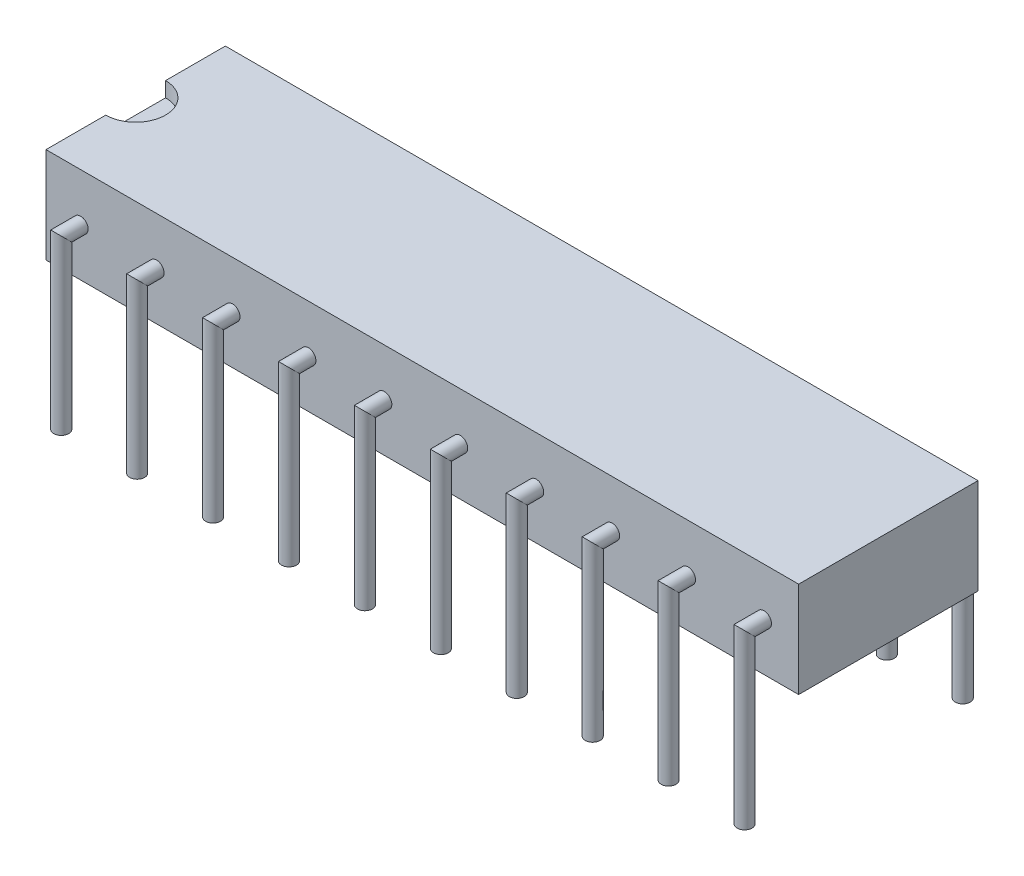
from build123d import *

# Parameters (mm, degrees)
ESQUISSE1_W                          = 6
ESQUISSE1_H                          = 3.2
EXTRUSION1_DEPTH                     = 25.18
ENL_V_MAT_EXTRU_1_DEPTH              = 0.5
ESQUISSE3_R                          = 0.25
R_P_TITION_LIN_AIRE1_COUNT           = 10
R_P_TITION_LIN_AIRE1_PITCH           = 2.54
R_P_TITION_LIN_AIRE1_COPY_1_SKETCH_R = 0.25
R_P_TITION_LIN_AIRE1_COPY_2_SKETCH_R = 0.25
R_P_TITION_LIN_AIRE1_COPY_3_SKETCH_R = 0.25
R_P_TITION_LIN_AIRE1_COPY_4_SKETCH_R = 0.25
R_P_TITION_LIN_AIRE1_COPY_5_SKETCH_R = 0.25
R_P_TITION_LIN_AIRE1_COPY_6_SKETCH_R = 0.25
R_P_TITION_LIN_AIRE1_COPY_7_SKETCH_R = 0.25
R_P_TITION_LIN_AIRE1_COPY_8_SKETCH_R = 0.25
R_P_TITION_LIN_AIRE1_COPY_9_SKETCH_R = 0.25


with BuildPart() as part:
    # Esquisse1 → Extrusion1 (new body)
    with BuildSketch(Plane(origin=(0, 0, 0), x_dir=(0, 0, -1), z_dir=(1, 0, 0))):
        with Locations((0, 1.6)):
            Rectangle(ESQUISSE1_W, ESQUISSE1_H)
    extrude(amount=EXTRUSION1_DEPTH)

    # Esquisse2 → Enl_v. mat.-Extru.1 (cut)
    with BuildSketch(Plane(origin=(0, 3.2, 0), x_dir=(-1, 0, 0), z_dir=(0, 1, 0))):
        with BuildLine():
            Line((0, -1), (0, 1))
            ThreePointArc((0, 1), (-1, 0), (0, -1))
        make_face()
    extrude(amount=-ENL_V_MAT_EXTRU_1_DEPTH, mode=Mode.SUBTRACT)

    # Balayage1: sweep along a path in Esquisse5
    with BuildLine(Plane(origin=(1.16, 0, 0), x_dir=(0, 0, -1), z_dir=(1, 0, 0))) as balayage1_path:
        Line((-3, 1.6), (-3.65, 1.6))
        Line((-3.65, 1.6), (-3.65, -4))
    # Esquisse3 → Balayage1 (sweep)
    with BuildSketch(Plane.XY.offset(3)):
        with Locations((1.16, 1.6)):
            Circle(ESQUISSE3_R)
    balayage1 = sweep(path=balayage1_path.line, transition=Transition.RIGHT)

    # Sym_trie1: Balayage1 across plane
    add(balayage1.mirror(Plane.XY))

    # R_p_tition lin_aire1: Balayage1 ×10
    with Locations(*[(i * R_P_TITION_LIN_AIRE1_PITCH, 0, 0) for i in range(1, R_P_TITION_LIN_AIRE1_COUNT)]):
        add(balayage1)

    # R_p_tition lin_aire1 copy 1: sweep along a path in R_p_tition lin_aire1 copy 1 path
    with BuildLine(Plane(origin=(3.7, 0, 0), x_dir=(0, 0, 1), z_dir=(1, 0, 0))) as r_p_tition_lin_aire1_copy_1_path:
        Line((-3, -1.6), (-3.65, -1.6))
        Line((-3.65, -1.6), (-3.65, 4))
    # R_p_tition lin_aire1 copy 1 sketch → R_p_tition lin_aire1 copy 1 (sweep)
    with BuildSketch(Plane(origin=(2.54, 0, -3), x_dir=(1, 0, 0), z_dir=(0, 0, -1))):
        with Locations((1.16, -1.6)):
            Circle(R_P_TITION_LIN_AIRE1_COPY_1_SKETCH_R)
    sweep(path=r_p_tition_lin_aire1_copy_1_path.line, transition=Transition.RIGHT)

    # R_p_tition lin_aire1 copy 2: sweep along a path in R_p_tition lin_aire1 copy 2 path
    with BuildLine(Plane(origin=(6.24, 0, 0), x_dir=(0, 0, 1), z_dir=(1, 0, 0))) as r_p_tition_lin_aire1_copy_2_path:
        Line((-3, -1.6), (-3.65, -1.6))
        Line((-3.65, -1.6), (-3.65, 4))
    # R_p_tition lin_aire1 copy 2 sketch → R_p_tition lin_aire1 copy 2 (sweep)
    with BuildSketch(Plane(origin=(5.08, 0, -3), x_dir=(1, 0, 0), z_dir=(0, 0, -1))):
        with Locations((1.16, -1.6)):
            Circle(R_P_TITION_LIN_AIRE1_COPY_2_SKETCH_R)
    sweep(path=r_p_tition_lin_aire1_copy_2_path.line, transition=Transition.RIGHT)

    # R_p_tition lin_aire1 copy 3: sweep along a path in R_p_tition lin_aire1 copy 3 path
    with BuildLine(Plane(origin=(8.78, 0, 0), x_dir=(0, 0, 1), z_dir=(1, 0, 0))) as r_p_tition_lin_aire1_copy_3_path:
        Line((-3, -1.6), (-3.65, -1.6))
        Line((-3.65, -1.6), (-3.65, 4))
    # R_p_tition lin_aire1 copy 3 sketch → R_p_tition lin_aire1 copy 3 (sweep)
    with BuildSketch(Plane(origin=(7.62, 0, -3), x_dir=(1, 0, 0), z_dir=(0, 0, -1))):
        with Locations((1.16, -1.6)):
            Circle(R_P_TITION_LIN_AIRE1_COPY_3_SKETCH_R)
    sweep(path=r_p_tition_lin_aire1_copy_3_path.line, transition=Transition.RIGHT)

    # R_p_tition lin_aire1 copy 4: sweep along a path in R_p_tition lin_aire1 copy 4 path
    with BuildLine(Plane(origin=(11.32, 0, 0), x_dir=(0, 0, 1), z_dir=(1, 0, 0))) as r_p_tition_lin_aire1_copy_4_path:
        Line((-3, -1.6), (-3.65, -1.6))
        Line((-3.65, -1.6), (-3.65, 4))
    # R_p_tition lin_aire1 copy 4 sketch → R_p_tition lin_aire1 copy 4 (sweep)
    with BuildSketch(Plane(origin=(10.16, 0, -3), x_dir=(1, 0, 0), z_dir=(0, 0, -1))):
        with Locations((1.16, -1.6)):
            Circle(R_P_TITION_LIN_AIRE1_COPY_4_SKETCH_R)
    sweep(path=r_p_tition_lin_aire1_copy_4_path.line, transition=Transition.RIGHT)

    # R_p_tition lin_aire1 copy 5: sweep along a path in R_p_tition lin_aire1 copy 5 path
    with BuildLine(Plane(origin=(13.86, 0, 0), x_dir=(0, 0, 1), z_dir=(1, 0, 0))) as r_p_tition_lin_aire1_copy_5_path:
        Line((-3, -1.6), (-3.65, -1.6))
        Line((-3.65, -1.6), (-3.65, 4))
    # R_p_tition lin_aire1 copy 5 sketch → R_p_tition lin_aire1 copy 5 (sweep)
    with BuildSketch(Plane(origin=(12.7, 0, -3), x_dir=(1, 0, 0), z_dir=(0, 0, -1))):
        with Locations((1.16, -1.6)):
            Circle(R_P_TITION_LIN_AIRE1_COPY_5_SKETCH_R)
    sweep(path=r_p_tition_lin_aire1_copy_5_path.line, transition=Transition.RIGHT)

    # R_p_tition lin_aire1 copy 6: sweep along a path in R_p_tition lin_aire1 copy 6 path
    with BuildLine(Plane(origin=(16.4, 0, 0), x_dir=(0, 0, 1), z_dir=(1, 0, 0))) as r_p_tition_lin_aire1_copy_6_path:
        Line((-3, -1.6), (-3.65, -1.6))
        Line((-3.65, -1.6), (-3.65, 4))
    # R_p_tition lin_aire1 copy 6 sketch → R_p_tition lin_aire1 copy 6 (sweep)
    with BuildSketch(Plane(origin=(15.24, 0, -3), x_dir=(1, 0, 0), z_dir=(0, 0, -1))):
        with Locations((1.16, -1.6)):
            Circle(R_P_TITION_LIN_AIRE1_COPY_6_SKETCH_R)
    sweep(path=r_p_tition_lin_aire1_copy_6_path.line, transition=Transition.RIGHT)

    # R_p_tition lin_aire1 copy 7: sweep along a path in R_p_tition lin_aire1 copy 7 path
    with BuildLine(Plane(origin=(18.94, 0, 0), x_dir=(0, 0, 1), z_dir=(1, 0, 0))) as r_p_tition_lin_aire1_copy_7_path:
        Line((-3, -1.6), (-3.65, -1.6))
        Line((-3.65, -1.6), (-3.65, 4))
    # R_p_tition lin_aire1 copy 7 sketch → R_p_tition lin_aire1 copy 7 (sweep)
    with BuildSketch(Plane(origin=(17.78, 0, -3), x_dir=(1, 0, 0), z_dir=(0, 0, -1))):
        with Locations((1.16, -1.6)):
            Circle(R_P_TITION_LIN_AIRE1_COPY_7_SKETCH_R)
    sweep(path=r_p_tition_lin_aire1_copy_7_path.line, transition=Transition.RIGHT)

    # R_p_tition lin_aire1 copy 8: sweep along a path in R_p_tition lin_aire1 copy 8 path
    with BuildLine(Plane(origin=(21.48, 0, 0), x_dir=(0, 0, 1), z_dir=(1, 0, 0))) as r_p_tition_lin_aire1_copy_8_path:
        Line((-3, -1.6), (-3.65, -1.6))
        Line((-3.65, -1.6), (-3.65, 4))
    # R_p_tition lin_aire1 copy 8 sketch → R_p_tition lin_aire1 copy 8 (sweep)
    with BuildSketch(Plane(origin=(20.32, 0, -3), x_dir=(1, 0, 0), z_dir=(0, 0, -1))):
        with Locations((1.16, -1.6)):
            Circle(R_P_TITION_LIN_AIRE1_COPY_8_SKETCH_R)
    sweep(path=r_p_tition_lin_aire1_copy_8_path.line, transition=Transition.RIGHT)

    # R_p_tition lin_aire1 copy 9: sweep along a path in R_p_tition lin_aire1 copy 9 path
    with BuildLine(Plane(origin=(24.02, 0, 0), x_dir=(0, 0, 1), z_dir=(1, 0, 0))) as r_p_tition_lin_aire1_copy_9_path:
        Line((-3, -1.6), (-3.65, -1.6))
        Line((-3.65, -1.6), (-3.65, 4))
    # R_p_tition lin_aire1 copy 9 sketch → R_p_tition lin_aire1 copy 9 (sweep)
    with BuildSketch(Plane(origin=(22.86, 0, -3), x_dir=(1, 0, 0), z_dir=(0, 0, -1))):
        with Locations((1.16, -1.6)):
            Circle(R_P_TITION_LIN_AIRE1_COPY_9_SKETCH_R)
    sweep(path=r_p_tition_lin_aire1_copy_9_path.line, transition=Transition.RIGHT)


solid = part.part
